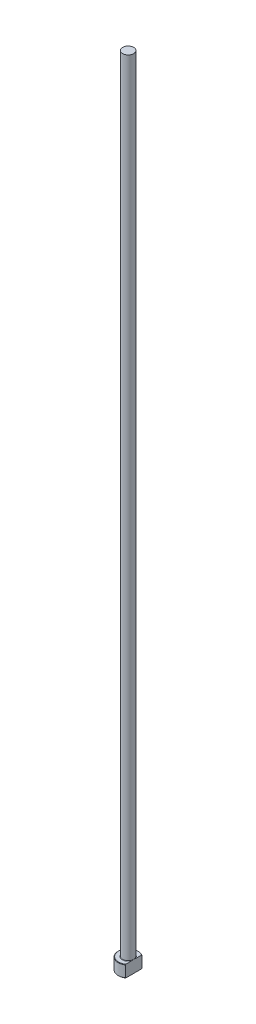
ISO-10303-21;
HEADER;
FILE_DESCRIPTION(('STEP AP214'),'2;1');
FILE_NAME('part.step','',(''),(''),'','','');
FILE_SCHEMA(('AUTOMOTIVE_DESIGN { 1 0 10303 214 1 1 1 1 }'));
ENDSEC;
DATA;
#1=APPLICATION_CONTEXT('core data for automotive mechanical design processes');
#2=APPLICATION_PROTOCOL_DEFINITION('international standard','automotive_design',2000,#1);
#3=PRODUCT_CONTEXT('',#1,'mechanical');
#4=PRODUCT('Part','Part','',(#3));
#5=PRODUCT_RELATED_PRODUCT_CATEGORY('part','',(#4));
#6=PRODUCT_DEFINITION_FORMATION('','',#4);
#7=PRODUCT_DEFINITION_CONTEXT('part definition',#1,'design');
#8=PRODUCT_DEFINITION('design','',#6,#7);
#9=PRODUCT_DEFINITION_SHAPE('','',#8);
#10=(LENGTH_UNIT() NAMED_UNIT(*) SI_UNIT(.MILLI.,.METRE.));
#11=(NAMED_UNIT(*) PLANE_ANGLE_UNIT() SI_UNIT($,.RADIAN.));
#12=(NAMED_UNIT(*) SI_UNIT($,.STERADIAN.) SOLID_ANGLE_UNIT());
#13=UNCERTAINTY_MEASURE_WITH_UNIT(LENGTH_MEASURE(1.E-05),#10,'distance_accuracy_value','');
#14=(GEOMETRIC_REPRESENTATION_CONTEXT(3) GLOBAL_UNCERTAINTY_ASSIGNED_CONTEXT((#13)) GLOBAL_UNIT_ASSIGNED_CONTEXT((#10,
#11,#12)) REPRESENTATION_CONTEXT('',''));
#15=CARTESIAN_POINT('',(0.,0.,0.));
#16=DIRECTION('',(0.,0.,1.));
#17=DIRECTION('',(1.,0.,0.));
#18=AXIS2_PLACEMENT_3D('',#15,#16,#17);
#19=CARTESIAN_POINT('',(0.,0.,0.));
#20=DIRECTION('',(0.,-1.,0.));
#21=DIRECTION('',(0.,0.,-1.));
#22=AXIS2_PLACEMENT_3D('',#19,#20,#21);
#23=PLANE('',#22);
#24=CARTESIAN_POINT('',(0.,0.,0.));
#25=DIRECTION('',(0.,-1.,0.));
#26=DIRECTION('',(0.,0.,-1.));
#27=AXIS2_PLACEMENT_3D('',#24,#25,#26);
#28=CIRCLE('',#27,4.79999999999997);
#29=CARTESIAN_POINT('',(2.74999999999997,0.,3.93414539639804));
#30=VERTEX_POINT('',#29);
#31=CARTESIAN_POINT('',(2.74999999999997,0.,-3.93414539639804));
#32=VERTEX_POINT('',#31);
#33=EDGE_CURVE('E98',#30,#32,#28,.T.);
#34=ORIENTED_EDGE('',*,*,#33,.T.);
#35=DIRECTION('',(0.,0.,1.));
#36=VECTOR('',#35,1.);
#37=CARTESIAN_POINT('',(2.74999999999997,0.,4.1758232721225));
#38=LINE('',#37,#36);
#39=EDGE_CURVE('E83',#32,#30,#38,.T.);
#40=ORIENTED_EDGE('',*,*,#39,.T.);
#41=EDGE_LOOP('',(#34,#40));
#42=FACE_BOUND('',#41,.T.);
#43=ADVANCED_FACE('F32',(#42),#23,.T.);
#44=CARTESIAN_POINT('',(0.,259.958771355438,0.));
#45=DIRECTION('',(0.,1.,0.));
#46=DIRECTION('',(0.,0.,1.));
#47=AXIS2_PLACEMENT_3D('',#44,#45,#46);
#48=CYLINDRICAL_SURFACE('',#47,4.99999999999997);
#49=CARTESIAN_POINT('',(0.,5.80000000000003,0.));
#50=DIRECTION('',(0.,1.,0.));
#51=DIRECTION('',(0.,0.,1.));
#52=AXIS2_PLACEMENT_3D('',#49,#50,#51);
#53=CIRCLE('',#52,4.99999999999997);
#54=CARTESIAN_POINT('',(2.74999999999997,5.80000000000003,4.1758232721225));
#55=VERTEX_POINT('',#54);
#56=CARTESIAN_POINT('',(2.74999999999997,5.80000000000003,-4.1758232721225));
#57=VERTEX_POINT('',#56);
#58=EDGE_CURVE('E104',#55,#57,#53,.F.);
#59=ORIENTED_EDGE('',*,*,#58,.T.);
#60=DIRECTION('',(0.,-1.,0.));
#61=VECTOR('',#60,1.);
#62=CARTESIAN_POINT('',(2.74999999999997,400.,-4.1758232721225));
#63=LINE('',#62,#61);
#64=CARTESIAN_POINT('',(2.74999999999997,0.199999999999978,-4.1758232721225));
#65=VERTEX_POINT('',#64);
#66=EDGE_CURVE('E183',#57,#65,#63,.T.);
#67=ORIENTED_EDGE('',*,*,#66,.T.);
#68=CARTESIAN_POINT('',(0.,0.199999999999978,0.));
#69=DIRECTION('',(0.,-1.,0.));
#70=DIRECTION('',(0.,0.,-1.));
#71=AXIS2_PLACEMENT_3D('',#68,#69,#70);
#72=CIRCLE('',#71,4.99999999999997);
#73=CARTESIAN_POINT('',(2.74999999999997,0.199999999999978,4.1758232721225));
#74=VERTEX_POINT('',#73);
#75=EDGE_CURVE('E100',#65,#74,#72,.F.);
#76=ORIENTED_EDGE('',*,*,#75,.T.);
#77=DIRECTION('',(0.,-1.,0.));
#78=VECTOR('',#77,1.);
#79=CARTESIAN_POINT('',(2.74999999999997,400.,4.1758232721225));
#80=LINE('',#79,#78);
#81=EDGE_CURVE('E93',#55,#74,#80,.T.);
#82=ORIENTED_EDGE('',*,*,#81,.F.);
#83=EDGE_LOOP('',(#59,#67,#76,#82));
#84=FACE_BOUND('',#83,.T.);
#85=ADVANCED_FACE('F158',(#84),#48,.T.);
#86=CARTESIAN_POINT('',(-4.99999999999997,6.,0.));
#87=DIRECTION('',(0.,1.,0.));
#88=DIRECTION('',(0.,0.,1.));
#89=AXIS2_PLACEMENT_3D('',#86,#87,#88);
#90=PLANE('',#89);
#91=CARTESIAN_POINT('',(0.,6.,0.));
#92=DIRECTION('',(0.,1.,0.));
#93=DIRECTION('',(0.,0.,1.));
#94=AXIS2_PLACEMENT_3D('',#91,#92,#93);
#95=CIRCLE('',#94,4.79999999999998);
#96=CARTESIAN_POINT('',(2.74999999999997,6.,-3.93414539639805));
#97=VERTEX_POINT('',#96);
#98=CARTESIAN_POINT('',(2.74999999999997,6.,3.93414539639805));
#99=VERTEX_POINT('',#98);
#100=EDGE_CURVE('E178',#97,#99,#95,.T.);
#101=ORIENTED_EDGE('',*,*,#100,.T.);
#102=DIRECTION('',(0.,0.,-1.));
#103=VECTOR('',#102,1.);
#104=CARTESIAN_POINT('',(2.74999999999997,6.,0.));
#105=LINE('',#104,#103);
#106=CARTESIAN_POINT('',(2.74999999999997,5.99999999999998,1.06770782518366));
#107=VERTEX_POINT('',#106);
#108=EDGE_CURVE('E57',#99,#107,#105,.T.);
#109=ORIENTED_EDGE('',*,*,#108,.T.);
#110=CARTESIAN_POINT('',(0.,6.,0.));
#111=DIRECTION('',(0.,1.,0.));
#112=DIRECTION('',(0.,0.,1.));
#113=AXIS2_PLACEMENT_3D('',#110,#111,#112);
#114=CIRCLE('',#113,2.94999999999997);
#115=CARTESIAN_POINT('',(2.74999999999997,5.99999999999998,-1.06770782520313));
#116=VERTEX_POINT('',#115);
#117=EDGE_CURVE('E107',#107,#116,#114,.F.);
#118=ORIENTED_EDGE('',*,*,#117,.T.);
#119=EDGE_CURVE('E136',#116,#97,#105,.T.);
#120=ORIENTED_EDGE('',*,*,#119,.T.);
#121=EDGE_LOOP('',(#101,#109,#118,#120));
#122=FACE_BOUND('',#121,.T.);
#123=ADVANCED_FACE('F147',(#122),#90,.T.);
#124=CARTESIAN_POINT('',(0.,6.00000000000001,0.));
#125=DIRECTION('',(0.,-1.,0.));
#126=DIRECTION('',(0.,0.,-1.));
#127=AXIS2_PLACEMENT_3D('',#124,#125,#126);
#128=CONICAL_SURFACE('',#127,4.79999999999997,0.785398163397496);
#129=ORIENTED_EDGE('',*,*,#58,.F.);
#130=CARTESIAN_POINT('',(2.74999999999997,1.20885441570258,9.18844783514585));
#131=CARTESIAN_POINT('',(2.74999999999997,1.37523675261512,9.0147689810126));
#132=CARTESIAN_POINT('',(2.74999999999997,1.5414218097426,8.84090089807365));
#133=CARTESIAN_POINT('',(2.74999999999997,1.87331224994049,8.49270511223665));
#134=CARTESIAN_POINT('',(2.74999999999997,2.03901762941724,8.31837740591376));
#135=CARTESIAN_POINT('',(2.74999999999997,2.53536746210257,7.79449769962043));
#136=CARTESIAN_POINT('',(2.74999999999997,2.86516041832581,7.44413786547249));
#137=CARTESIAN_POINT('',(2.74999999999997,3.52140645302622,6.74030951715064));
#138=CARTESIAN_POINT('',(2.74999999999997,3.84785962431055,6.38684108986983));
#139=CARTESIAN_POINT('',(2.74999999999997,4.33353933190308,5.85303151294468));
#140=CARTESIAN_POINT('',(2.74999999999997,4.49475728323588,5.67450358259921));
#141=CARTESIAN_POINT('',(2.74999999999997,4.8154555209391,5.31589537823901));
#142=CARTESIAN_POINT('',(2.74999999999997,4.97493583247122,5.13581512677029));
#143=CARTESIAN_POINT('',(2.74999999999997,5.28246157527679,4.78409714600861));
#144=CARTESIAN_POINT('',(2.74999999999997,5.43063567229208,4.6125721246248));
#145=CARTESIAN_POINT('',(2.74999999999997,5.72427023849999,4.26717959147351));
#146=CARTESIAN_POINT('',(2.74999999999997,5.86973045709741,4.09331186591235));
#147=CARTESIAN_POINT('',(2.74999999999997,6.15716227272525,3.74214491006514));
#148=CARTESIAN_POINT('',(2.74999999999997,6.29912659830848,3.56483970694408));
#149=CARTESIAN_POINT('',(2.74999999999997,6.57763983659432,3.20603939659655));
#150=CARTESIAN_POINT('',(2.74999999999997,6.7141898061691,3.02454511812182));
#151=CARTESIAN_POINT('',(2.74999999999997,6.93857405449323,2.71219163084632));
#152=CARTESIAN_POINT('',(2.74999999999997,7.02851673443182,2.58285434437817));
#153=CARTESIAN_POINT('',(2.74999999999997,7.20308451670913,2.32054245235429));
#154=CARTESIAN_POINT('',(2.74999999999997,7.28770764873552,2.18756652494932));
#155=CARTESIAN_POINT('',(2.74999999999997,7.44931959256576,1.91735675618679));
#156=CARTESIAN_POINT('',(2.74999999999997,7.52632375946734,1.7801322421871));
#157=CARTESIAN_POINT('',(2.74999999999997,7.66966790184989,1.50031327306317));
#158=CARTESIAN_POINT('',(2.74999999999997,7.73601725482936,1.35772367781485));
#159=CARTESIAN_POINT('',(2.74999999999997,7.86065113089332,1.04856386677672));
#160=CARTESIAN_POINT('',(2.74999999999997,7.91700799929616,0.881171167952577));
#161=CARTESIAN_POINT('',(2.74999999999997,7.9810280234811,0.625229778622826));
#162=CARTESIAN_POINT('',(2.74999999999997,7.99893817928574,0.539229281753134));
#163=CARTESIAN_POINT('',(2.74999999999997,8.02707157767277,0.365959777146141));
#164=CARTESIAN_POINT('',(2.74999999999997,8.03729562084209,0.278690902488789));
#165=CARTESIAN_POINT('',(2.74999999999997,8.04949232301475,0.102763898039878));
#166=CARTESIAN_POINT('',(2.74999999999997,8.05138838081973,0.0141003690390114));
#167=CARTESIAN_POINT('',(2.74999999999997,8.04659669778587,-0.162990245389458));
#168=CARTESIAN_POINT('',(2.74999999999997,8.03990892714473,-0.251417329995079));
#169=CARTESIAN_POINT('',(2.74999999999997,8.0183553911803,-0.427430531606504));
#170=CARTESIAN_POINT('',(2.74999999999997,8.00347341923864,-0.51501463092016));
#171=CARTESIAN_POINT('',(2.74999999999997,7.96636720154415,-0.688602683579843));
#172=CARTESIAN_POINT('',(2.74999999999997,7.94414138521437,-0.774606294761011));
#173=CARTESIAN_POINT('',(2.74999999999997,7.88037969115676,-0.988315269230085));
#174=CARTESIAN_POINT('',(2.74999999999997,7.8347849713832,-1.11480587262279));
#175=CARTESIAN_POINT('',(2.74999999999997,7.73271903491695,-1.36329985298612));
#176=CARTESIAN_POINT('',(2.74999999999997,7.67623944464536,-1.48529968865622));
#177=CARTESIAN_POINT('',(2.74999999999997,7.55498227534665,-1.72582737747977));
#178=CARTESIAN_POINT('',(2.74999999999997,7.49016436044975,-1.84433466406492));
#179=CARTESIAN_POINT('',(2.74999999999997,7.38849038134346,-2.01944141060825));
#180=CARTESIAN_POINT('',(2.74999999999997,7.35386385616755,-2.07735876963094));
#181=CARTESIAN_POINT('',(2.74999999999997,7.28331846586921,-2.19239883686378));
#182=CARTESIAN_POINT('',(2.74999999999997,7.24739965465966,-2.24952157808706));
#183=CARTESIAN_POINT('',(2.74999999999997,7.12488368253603,-2.44019263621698));
#184=CARTESIAN_POINT('',(2.74999999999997,7.03574833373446,-2.57211125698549));
#185=CARTESIAN_POINT('',(2.74999999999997,6.85300432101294,-2.83282496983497));
#186=CARTESIAN_POINT('',(2.74999999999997,6.7593946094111,-2.96161931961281));
#187=CARTESIAN_POINT('',(2.74999999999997,6.56878484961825,-3.2168121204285));
#188=CARTESIAN_POINT('',(2.74999999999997,6.47178237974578,-3.34320875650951));
#189=CARTESIAN_POINT('',(2.74999999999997,6.27524323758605,-3.59402090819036));
#190=CARTESIAN_POINT('',(2.74999999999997,6.17570641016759,-3.71843630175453));
#191=CARTESIAN_POINT('',(2.74999999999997,5.97442282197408,-3.96596722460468));
#192=CARTESIAN_POINT('',(2.74999999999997,5.8726712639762,-4.08907884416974));
#193=CARTESIAN_POINT('',(2.74999999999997,5.66760125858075,-4.3339916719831));
#194=CARTESIAN_POINT('',(2.74999999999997,5.56428277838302,-4.45579285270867));
#195=CARTESIAN_POINT('',(2.74999999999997,5.25255029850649,-4.81947940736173));
#196=CARTESIAN_POINT('',(2.74999999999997,5.04226620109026,-5.05976099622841));
#197=CARTESIAN_POINT('',(2.74999999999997,4.61812846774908,-5.5376054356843));
#198=CARTESIAN_POINT('',(2.74999999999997,4.40427119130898,-5.77516503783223));
#199=CARTESIAN_POINT('',(2.74999999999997,3.97415714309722,-6.24814387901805));
#200=CARTESIAN_POINT('',(2.74999999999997,3.75790012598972,-6.48356289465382));
#201=CARTESIAN_POINT('',(2.74999999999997,3.32391192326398,-6.95249982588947));
#202=CARTESIAN_POINT('',(2.74999999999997,3.10618287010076,-7.18601971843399));
#203=CARTESIAN_POINT('',(2.74999999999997,2.66941287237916,-7.65182952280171));
#204=CARTESIAN_POINT('',(2.74999999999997,2.45037192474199,-7.88411943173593));
#205=CARTESIAN_POINT('',(2.74999999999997,2.14586495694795,-8.20563072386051));
#206=CARTESIAN_POINT('',(2.74999999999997,2.06083046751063,-8.29526139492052));
#207=CARTESIAN_POINT('',(2.74999999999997,1.89060889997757,-8.47440444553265));
#208=CARTESIAN_POINT('',(2.74999999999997,1.80542180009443,-8.56391680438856));
#209=CARTESIAN_POINT('',(2.74999999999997,1.63506457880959,-8.74266965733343));
#210=CARTESIAN_POINT('',(2.74999999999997,1.5498946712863,-8.83191035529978));
#211=CARTESIAN_POINT('',(2.74999999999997,1.37945223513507,-9.01026683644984));
#212=CARTESIAN_POINT('',(2.74999999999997,1.29417972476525,-9.09938263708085));
#213=CARTESIAN_POINT('',(2.74999999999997,1.20885441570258,-9.18844783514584));
#214=B_SPLINE_CURVE_WITH_KNOTS('',3,(#130,#131,#132,#133,#134,#135,#136,#137,#138,#139,#140,
#141,#142,#143,#144,#145,#146,#147,#148,#149,#150,#151,#152,#153,#154,#155,#156,#157,#158,#159,
#160,#161,#162,#163,#164,#165,#166,#167,#168,#169,#170,#171,#172,#173,#174,#175,#176,#177,#178,
#179,#180,#181,#182,#183,#184,#185,#186,#187,#188,#189,#190,#191,#192,#193,#194,#195,#196,#197,
#198,#199,#200,#201,#202,#203,#204,#205,#206,#207,#208,#209,#210,#211,#212,#213),.UNSPECIFIED.,
.F.,.F.,(4,2,2,2,2,2,2,2,2,2,2,2,2,2,2,2,2,2,2,2,2,2,2,2,2,2,2,2,2,2,2,2,2,2,2,2,2,2,2,2,2,4),
(0.,0.721544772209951,1.44309493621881,2.88656432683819,4.32999349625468,5.05163004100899,
5.77325612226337,6.45322671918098,7.13325979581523,7.81460476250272,8.49581607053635,
8.96833065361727,9.4410192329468,9.91273488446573,10.3840330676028,10.9119743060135,
11.1752192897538,11.4384368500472,11.7040704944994,11.9697050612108,12.2358669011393,
12.5020857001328,12.9047274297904,13.3076801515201,13.712661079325,13.9150857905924,
14.1175020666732,14.5949844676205,15.0725792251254,15.5505221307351,16.0284943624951,
16.5076321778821,16.9867800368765,17.94463622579,18.9035363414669,19.862535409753,
20.8203587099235,21.7781842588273,22.1488332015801,22.5195401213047,22.889621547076,
23.259644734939),.UNSPECIFIED.);
#215=EDGE_CURVE('E135',#55,#99,#214,.T.);
#216=ORIENTED_EDGE('',*,*,#215,.T.);
#217=ORIENTED_EDGE('',*,*,#100,.F.);
#218=EDGE_CURVE('E127',#97,#57,#214,.T.);
#219=ORIENTED_EDGE('',*,*,#218,.T.);
#220=EDGE_LOOP('',(#129,#216,#217,#219));
#221=FACE_BOUND('',#220,.T.);
#222=ADVANCED_FACE('F143',(#221),#128,.T.);
#223=CARTESIAN_POINT('',(0.,0.199999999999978,0.));
#224=DIRECTION('',(0.,1.,0.));
#225=DIRECTION('',(0.,0.,1.));
#226=AXIS2_PLACEMENT_3D('',#223,#224,#225);
#227=CONICAL_SURFACE('',#226,4.99999999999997,0.785398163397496);
#228=ORIENTED_EDGE('',*,*,#75,.F.);
#229=CARTESIAN_POINT('',(2.74999999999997,4.79114558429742,-9.18844783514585));
#230=CARTESIAN_POINT('',(2.74999999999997,4.62476324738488,-9.0147689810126));
#231=CARTESIAN_POINT('',(2.74999999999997,4.45857819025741,-8.84090089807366));
#232=CARTESIAN_POINT('',(2.74999999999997,4.12668775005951,-8.49270511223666));
#233=CARTESIAN_POINT('',(2.74999999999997,3.96098237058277,-8.31837740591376));
#234=CARTESIAN_POINT('',(2.74999999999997,3.46463253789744,-7.79449769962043));
#235=CARTESIAN_POINT('',(2.74999999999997,3.13483958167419,-7.44413786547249));
#236=CARTESIAN_POINT('',(2.74999999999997,2.47859354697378,-6.74030951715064));
#237=CARTESIAN_POINT('',(2.74999999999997,2.15214037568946,-6.38684108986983));
#238=CARTESIAN_POINT('',(2.74999999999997,1.66646066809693,-5.85303151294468));
#239=CARTESIAN_POINT('',(2.74999999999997,1.50524271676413,-5.67450358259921));
#240=CARTESIAN_POINT('',(2.74999999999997,1.1845444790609,-5.31589537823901));
#241=CARTESIAN_POINT('',(2.74999999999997,1.02506416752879,-5.13581512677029));
#242=CARTESIAN_POINT('',(2.74999999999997,0.717538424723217,-4.78409714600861));
#243=CARTESIAN_POINT('',(2.74999999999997,0.569364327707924,-4.6125721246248));
#244=CARTESIAN_POINT('',(2.74999999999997,0.275729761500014,-4.26717959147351));
#245=CARTESIAN_POINT('',(2.74999999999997,0.130269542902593,-4.09331186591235));
#246=CARTESIAN_POINT('',(2.74999999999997,-0.157162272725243,-3.74214491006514));
#247=CARTESIAN_POINT('',(2.74999999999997,-0.299126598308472,-3.56483970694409));
#248=CARTESIAN_POINT('',(2.74999999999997,-0.577639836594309,-3.20603939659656));
#249=CARTESIAN_POINT('',(2.74999999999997,-0.714189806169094,-3.02454511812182));
#250=CARTESIAN_POINT('',(2.74999999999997,-0.938574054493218,-2.71219163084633));
#251=CARTESIAN_POINT('',(2.74999999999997,-1.02851673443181,-2.58285434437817));
#252=CARTESIAN_POINT('',(2.74999999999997,-1.20308451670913,-2.3205424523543));
#253=CARTESIAN_POINT('',(2.74999999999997,-1.28770764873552,-2.18756652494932));
#254=CARTESIAN_POINT('',(2.74999999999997,-1.44931959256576,-1.91735675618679));
#255=CARTESIAN_POINT('',(2.74999999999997,-1.52632375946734,-1.7801322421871));
#256=CARTESIAN_POINT('',(2.74999999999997,-1.66966790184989,-1.50031327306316));
#257=CARTESIAN_POINT('',(2.74999999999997,-1.73601725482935,-1.35772367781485));
#258=CARTESIAN_POINT('',(2.74999999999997,-1.86065113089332,-1.04856386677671));
#259=CARTESIAN_POINT('',(2.74999999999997,-1.91700799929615,-0.881171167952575));
#260=CARTESIAN_POINT('',(2.74999999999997,-1.9810280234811,-0.625229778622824));
#261=CARTESIAN_POINT('',(2.74999999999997,-1.99893817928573,-0.539229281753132));
#262=CARTESIAN_POINT('',(2.74999999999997,-2.02707157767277,-0.365959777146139));
#263=CARTESIAN_POINT('',(2.74999999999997,-2.03729562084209,-0.278690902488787));
#264=CARTESIAN_POINT('',(2.74999999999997,-2.04949232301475,-0.102763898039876));
#265=CARTESIAN_POINT('',(2.74999999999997,-2.05138838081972,-0.0141003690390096));
#266=CARTESIAN_POINT('',(2.74999999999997,-2.04659669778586,0.16299024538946));
#267=CARTESIAN_POINT('',(2.74999999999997,-2.03990892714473,0.25141732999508));
#268=CARTESIAN_POINT('',(2.74999999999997,-2.01835539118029,0.427430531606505));
#269=CARTESIAN_POINT('',(2.74999999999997,-2.00347341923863,0.515014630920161));
#270=CARTESIAN_POINT('',(2.74999999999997,-1.96636720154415,0.688602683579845));
#271=CARTESIAN_POINT('',(2.74999999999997,-1.94414138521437,0.774606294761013));
#272=CARTESIAN_POINT('',(2.74999999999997,-1.88037969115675,0.988315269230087));
#273=CARTESIAN_POINT('',(2.74999999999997,-1.8347849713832,1.11480587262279));
#274=CARTESIAN_POINT('',(2.74999999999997,-1.73271903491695,1.36329985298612));
#275=CARTESIAN_POINT('',(2.74999999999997,-1.67623944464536,1.48529968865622));
#276=CARTESIAN_POINT('',(2.74999999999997,-1.55498227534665,1.72582737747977));
#277=CARTESIAN_POINT('',(2.74999999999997,-1.49016436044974,1.84433466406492));
#278=CARTESIAN_POINT('',(2.74999999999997,-1.38849038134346,2.01944141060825));
#279=CARTESIAN_POINT('',(2.74999999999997,-1.35386385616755,2.07735876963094));
#280=CARTESIAN_POINT('',(2.74999999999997,-1.2833184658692,2.19239883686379));
#281=CARTESIAN_POINT('',(2.74999999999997,-1.24739965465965,2.24952157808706));
#282=CARTESIAN_POINT('',(2.74999999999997,-1.12488368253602,2.44019263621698));
#283=CARTESIAN_POINT('',(2.74999999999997,-1.03574833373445,2.57211125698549));
#284=CARTESIAN_POINT('',(2.74999999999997,-0.853004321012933,2.83282496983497));
#285=CARTESIAN_POINT('',(2.74999999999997,-0.759394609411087,2.96161931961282));
#286=CARTESIAN_POINT('',(2.74999999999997,-0.568784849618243,3.21681212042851));
#287=CARTESIAN_POINT('',(2.74999999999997,-0.471782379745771,3.34320875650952));
#288=CARTESIAN_POINT('',(2.74999999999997,-0.275243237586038,3.59402090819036));
#289=CARTESIAN_POINT('',(2.74999999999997,-0.175706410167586,3.71843630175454));
#290=CARTESIAN_POINT('',(2.74999999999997,0.0255771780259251,3.96596722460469));
#291=CARTESIAN_POINT('',(2.74999999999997,0.127328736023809,4.08907884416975));
#292=CARTESIAN_POINT('',(2.74999999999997,0.332398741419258,4.3339916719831));
#293=CARTESIAN_POINT('',(2.74999999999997,0.435717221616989,4.45579285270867));
#294=CARTESIAN_POINT('',(2.74999999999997,0.747449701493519,4.81947940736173));
#295=CARTESIAN_POINT('',(2.74999999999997,0.957733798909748,5.05976099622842));
#296=CARTESIAN_POINT('',(2.74999999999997,1.38187153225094,5.5376054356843));
#297=CARTESIAN_POINT('',(2.74999999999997,1.59572880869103,5.77516503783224));
#298=CARTESIAN_POINT('',(2.74999999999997,2.0258428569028,6.24814387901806));
#299=CARTESIAN_POINT('',(2.74999999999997,2.2420998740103,6.48356289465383));
#300=CARTESIAN_POINT('',(2.74999999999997,2.67608807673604,6.95249982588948));
#301=CARTESIAN_POINT('',(2.74999999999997,2.89381712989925,7.186019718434));
#302=CARTESIAN_POINT('',(2.74999999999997,3.33058712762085,7.65182952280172));
#303=CARTESIAN_POINT('',(2.74999999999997,3.54962807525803,7.88411943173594));
#304=CARTESIAN_POINT('',(2.74999999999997,3.85413504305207,8.20563072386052));
#305=CARTESIAN_POINT('',(2.74999999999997,3.93916953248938,8.29526139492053));
#306=CARTESIAN_POINT('',(2.74999999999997,4.10939110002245,8.47440444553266));
#307=CARTESIAN_POINT('',(2.74999999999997,4.19457819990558,8.56391680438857));
#308=CARTESIAN_POINT('',(2.74999999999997,4.36493542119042,8.74266965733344));
#309=CARTESIAN_POINT('',(2.74999999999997,4.45010532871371,8.83191035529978));
#310=CARTESIAN_POINT('',(2.74999999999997,4.62054776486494,9.01026683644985));
#311=CARTESIAN_POINT('',(2.74999999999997,4.70582027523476,9.09938263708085));
#312=CARTESIAN_POINT('',(2.74999999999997,4.79114558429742,9.18844783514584));
#313=B_SPLINE_CURVE_WITH_KNOTS('',3,(#229,#230,#231,#232,#233,#234,#235,#236,#237,#238,#239,
#240,#241,#242,#243,#244,#245,#246,#247,#248,#249,#250,#251,#252,#253,#254,#255,#256,#257,#258,
#259,#260,#261,#262,#263,#264,#265,#266,#267,#268,#269,#270,#271,#272,#273,#274,#275,#276,#277,
#278,#279,#280,#281,#282,#283,#284,#285,#286,#287,#288,#289,#290,#291,#292,#293,#294,#295,#296,
#297,#298,#299,#300,#301,#302,#303,#304,#305,#306,#307,#308,#309,#310,#311,#312),.UNSPECIFIED.,
.F.,.F.,(4,2,2,2,2,2,2,2,2,2,2,2,2,2,2,2,2,2,2,2,2,2,2,2,2,2,2,2,2,2,2,2,2,2,2,2,2,2,2,2,2,4),
(0.,0.721544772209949,1.4430949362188,2.88656432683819,4.32999349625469,5.05163004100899,
5.77325612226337,6.45322671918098,7.13325979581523,7.81460476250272,8.49581607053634,
8.96833065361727,9.4410192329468,9.91273488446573,10.3840330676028,10.9119743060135,
11.1752192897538,11.4384368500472,11.7040704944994,11.9697050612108,12.2358669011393,
12.5020857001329,12.9047274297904,13.3076801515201,13.712661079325,13.9150857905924,
14.1175020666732,14.5949844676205,15.0725792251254,15.5505221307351,16.0284943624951,
16.5076321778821,16.9867800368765,17.94463622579,18.9035363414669,19.862535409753,
20.8203587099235,21.7781842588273,22.1488332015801,22.5195401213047,22.889621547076,
23.259644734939),.UNSPECIFIED.);
#314=EDGE_CURVE('E86',#65,#32,#313,.T.);
#315=ORIENTED_EDGE('',*,*,#314,.T.);
#316=ORIENTED_EDGE('',*,*,#33,.F.);
#317=EDGE_CURVE('E89',#30,#74,#313,.T.);
#318=ORIENTED_EDGE('',*,*,#317,.T.);
#319=EDGE_LOOP('',(#228,#315,#316,#318));
#320=FACE_BOUND('',#319,.T.);
#321=ADVANCED_FACE('F97',(#320),#227,.T.);
#322=CARTESIAN_POINT('',(0.,6.19999999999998,0.));
#323=DIRECTION('',(0.,1.,0.));
#324=DIRECTION('',(0.,0.,1.));
#325=AXIS2_PLACEMENT_3D('',#322,#323,#324);
#326=TOROIDAL_SURFACE('',#325,2.94999999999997,0.2);
#327=CARTESIAN_POINT('',(2.74999999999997,6.19999999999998,0.));
#328=CARTESIAN_POINT('',(2.74999999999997,6.20000050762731,1.12997189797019E-10));
#329=CARTESIAN_POINT('',(2.74999999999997,6.20000101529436,-1.81527538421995E-07));
#330=CARTESIAN_POINT('',(2.74999999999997,6.20000196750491,-6.94840321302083E-07));
#331=CARTESIAN_POINT('',(2.74999999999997,6.20000240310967,-1.03787718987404E-06));
#332=CARTESIAN_POINT('',(2.74999999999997,6.20000330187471,-1.85808129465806E-06));
#333=CARTESIAN_POINT('',(2.74999999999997,6.20000375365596,-2.34835983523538E-06));
#334=CARTESIAN_POINT('',(2.74999999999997,6.20000456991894,-3.37046961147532E-06));
#335=CARTESIAN_POINT('',(2.74999999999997,6.20000493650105,-3.90074161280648E-06));
#336=CARTESIAN_POINT('',(2.74999999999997,6.20000627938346,-5.93261734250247E-06));
#337=CARTESIAN_POINT('',(2.74999999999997,6.20000718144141,-7.48563177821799E-06));
#338=CARTESIAN_POINT('',(2.74999999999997,6.20000868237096,-1.05790083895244E-05));
#339=CARTESIAN_POINT('',(2.74999999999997,6.20000929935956,-1.21109700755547E-05));
#340=CARTESIAN_POINT('',(2.74999999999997,6.20001185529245,-1.85322193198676E-05));
#341=CARTESIAN_POINT('',(2.74999999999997,6.20001373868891,-2.34472712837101E-05));
#342=CARTESIAN_POINT('',(2.74999999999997,6.20001654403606,-3.27779453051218E-05));
#343=CARTESIAN_POINT('',(2.74999999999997,6.20001756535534,-3.71636224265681E-05));
#344=CARTESIAN_POINT('',(2.74999999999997,6.20002495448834,-6.95743734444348E-05));
#345=CARTESIAN_POINT('',(2.74999999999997,6.20003050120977,-9.77394526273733E-05));
#346=CARTESIAN_POINT('',(2.74999999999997,6.20005478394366,-0.000208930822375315));
#347=CARTESIAN_POINT('',(2.74999999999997,6.20007801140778,-0.000290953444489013));
#348=CARTESIAN_POINT('',(2.74999999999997,6.20016837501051,-0.000615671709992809));
#349=CARTESIAN_POINT('',(2.74999999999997,6.20023256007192,-0.000858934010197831));
#350=CARTESIAN_POINT('',(2.74999999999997,6.20048946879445,-0.00182516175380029));
#351=CARTESIAN_POINT('',(2.74999999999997,6.20068588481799,-0.00254739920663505));
#352=CARTESIAN_POINT('',(2.74999999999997,6.2015014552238,-0.00555461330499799));
#353=CARTESIAN_POINT('',(2.74999999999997,6.20211597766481,-0.00784050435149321));
#354=CARTESIAN_POINT('',(2.74999999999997,6.2075464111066,-0.028030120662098));
#355=CARTESIAN_POINT('',(2.74999999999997,6.21238054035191,-0.045930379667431));
#356=CARTESIAN_POINT('',(2.74999999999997,6.22182435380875,-0.0810299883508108));
#357=CARTESIAN_POINT('',(2.74999999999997,6.22643534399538,-0.0982290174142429));
#358=CARTESIAN_POINT('',(2.74999999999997,6.23620184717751,-0.134808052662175));
#359=CARTESIAN_POINT('',(2.74999999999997,6.24135263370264,-0.154189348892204));
#360=CARTESIAN_POINT('',(2.74999999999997,6.25163624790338,-0.19318178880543));
#361=CARTESIAN_POINT('',(2.74999999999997,6.25676827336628,-0.212793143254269));
#362=CARTESIAN_POINT('',(2.74999999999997,6.26905119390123,-0.260223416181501));
#363=CARTESIAN_POINT('',(2.74999999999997,6.27615177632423,-0.288055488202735));
#364=CARTESIAN_POINT('',(2.74999999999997,6.28988618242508,-0.343037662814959));
#365=CARTESIAN_POINT('',(2.74999999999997,6.29652742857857,-0.37018592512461));
#366=CARTESIAN_POINT('',(2.74999999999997,6.3179119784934,-0.460013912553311));
#367=CARTESIAN_POINT('',(2.74999999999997,6.33192996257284,-0.522872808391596));
#368=CARTESIAN_POINT('',(2.74999999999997,6.35724782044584,-0.649858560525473));
#369=CARTESIAN_POINT('',(2.74999999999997,6.36851625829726,-0.71399176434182));
#370=CARTESIAN_POINT('',(2.74999999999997,6.38744836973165,-0.848144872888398));
#371=CARTESIAN_POINT('',(2.74999999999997,6.39474814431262,-0.918222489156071));
#372=CARTESIAN_POINT('',(2.74999999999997,6.39971832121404,-1.02344881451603));
#373=CARTESIAN_POINT('',(2.74999999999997,6.40038441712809,-1.05845158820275));
#374=CARTESIAN_POINT('',(2.74999999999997,6.39917295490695,-1.1284044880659));
#375=CARTESIAN_POINT('',(2.74999999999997,6.39729798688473,-1.16335463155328));
#376=CARTESIAN_POINT('',(2.74999999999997,6.39199994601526,-1.21505383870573));
#377=CARTESIAN_POINT('',(2.74999999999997,6.38986571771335,-1.23193598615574));
#378=CARTESIAN_POINT('',(2.74999999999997,6.38464996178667,-1.2655715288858));
#379=CARTESIAN_POINT('',(2.74999999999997,6.38156766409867,-1.28232480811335));
#380=CARTESIAN_POINT('',(2.74999999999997,6.37431364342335,-1.31540767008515));
#381=CARTESIAN_POINT('',(2.74999999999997,6.37015411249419,-1.33173987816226));
#382=CARTESIAN_POINT('',(2.74999999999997,6.36048976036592,-1.36399299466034));
#383=CARTESIAN_POINT('',(2.74999999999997,6.35498646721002,-1.37991434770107));
#384=CARTESIAN_POINT('',(2.74999999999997,6.34222746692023,-1.41123903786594));
#385=CARTESIAN_POINT('',(2.74999999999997,6.33495457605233,-1.42663549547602));
#386=CARTESIAN_POINT('',(2.74999999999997,6.318175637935,-1.45617471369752));
#387=CARTESIAN_POINT('',(2.74999999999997,6.30867792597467,-1.4703218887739));
#388=CARTESIAN_POINT('',(2.74999999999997,6.29277007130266,-1.48907990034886));
#389=CARTESIAN_POINT('',(2.74999999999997,6.2875192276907,-1.49466894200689));
#390=CARTESIAN_POINT('',(2.74999999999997,6.27634440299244,-1.50515028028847));
#391=CARTESIAN_POINT('',(2.74999999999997,6.27042002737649,-1.51004216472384));
#392=CARTESIAN_POINT('',(2.74999999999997,6.25778482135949,-1.51891099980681));
#393=CARTESIAN_POINT('',(2.74999999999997,6.2510643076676,-1.52287446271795));
#394=CARTESIAN_POINT('',(2.74999999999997,6.23698143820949,-1.52941740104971));
#395=CARTESIAN_POINT('',(2.74999999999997,6.22962116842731,-1.53200119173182));
#396=CARTESIAN_POINT('',(2.74999999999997,6.2166326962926,-1.53496289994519));
#397=CARTESIAN_POINT('',(2.74999999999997,6.2110985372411,-1.53575651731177));
#398=CARTESIAN_POINT('',(2.74999999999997,6.19997558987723,-1.53638738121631));
#399=CARTESIAN_POINT('',(2.74999999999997,6.19438682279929,-1.53622498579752));
#400=CARTESIAN_POINT('',(2.74999999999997,6.18332943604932,-1.53495937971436));
#401=CARTESIAN_POINT('',(2.74999999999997,6.17786061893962,-1.53385785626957));
#402=CARTESIAN_POINT('',(2.74999999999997,6.16716525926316,-1.53080991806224));
#403=CARTESIAN_POINT('',(2.74999999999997,6.16193889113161,-1.52886290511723));
#404=CARTESIAN_POINT('',(2.74999999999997,6.14983366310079,-1.52335528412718));
#405=CARTESIAN_POINT('',(2.74999999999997,6.14310699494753,-1.51946144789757));
#406=CARTESIAN_POINT('',(2.74999999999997,6.13035821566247,-1.51065443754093));
#407=CARTESIAN_POINT('',(2.74999999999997,6.12433789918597,-1.5057387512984));
#408=CARTESIAN_POINT('',(2.74999999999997,6.10956608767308,-1.4920109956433));
#409=CARTESIAN_POINT('',(2.74999999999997,6.10134587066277,-1.48263193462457));
#410=CARTESIAN_POINT('',(2.74999999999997,6.08638427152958,-1.46278796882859));
#411=CARTESIAN_POINT('',(2.74999999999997,6.07964511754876,-1.45232146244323));
#412=CARTESIAN_POINT('',(2.74999999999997,6.06171675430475,-1.42080727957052));
#413=CARTESIAN_POINT('',(2.74999999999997,6.05211924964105,-1.39886385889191));
#414=CARTESIAN_POINT('',(2.74999999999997,6.03592584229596,-1.35377597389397));
#415=CARTESIAN_POINT('',(2.74999999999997,6.02935693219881,-1.33062268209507));
#416=CARTESIAN_POINT('',(2.74999999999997,6.01641276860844,-1.27469229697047));
#417=CARTESIAN_POINT('',(2.74999999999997,6.01110503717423,-1.24167224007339));
#418=CARTESIAN_POINT('',(2.74999999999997,6.00364182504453,-1.17522319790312));
#419=CARTESIAN_POINT('',(2.74999999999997,6.00149608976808,-1.1417932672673));
#420=CARTESIAN_POINT('',(2.74999999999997,5.99965905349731,-1.07618467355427));
#421=CARTESIAN_POINT('',(2.74999999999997,5.9998750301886,-1.04400821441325));
#422=CARTESIAN_POINT('',(2.74999999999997,6.00208041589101,-0.979705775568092));
#423=CARTESIAN_POINT('',(2.74999999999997,6.0040708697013,-0.947579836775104));
#424=CARTESIAN_POINT('',(2.74999999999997,6.01231998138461,-0.849711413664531));
#425=CARTESIAN_POINT('',(2.74999999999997,6.0208659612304,-0.784164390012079));
#426=CARTESIAN_POINT('',(2.74999999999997,6.04217753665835,-0.65215352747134));
#427=CARTESIAN_POINT('',(2.74999999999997,6.05504187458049,-0.585706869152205));
#428=CARTESIAN_POINT('',(2.74999999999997,6.07899589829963,-0.474257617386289));
#429=CARTESIAN_POINT('',(2.74999999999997,6.08936705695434,-0.429096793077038));
#430=CARTESIAN_POINT('',(2.74999999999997,6.11088695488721,-0.339494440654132));
#431=CARTESIAN_POINT('',(2.74999999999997,6.1220257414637,-0.295050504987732));
#432=CARTESIAN_POINT('',(2.74999999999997,6.14355229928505,-0.211341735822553));
#433=CARTESIAN_POINT('',(2.74999999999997,6.15388178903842,-0.172061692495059));
#434=CARTESIAN_POINT('',(2.74999999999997,6.17523671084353,-0.0918970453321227));
#435=CARTESIAN_POINT('',(2.74999999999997,6.18627305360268,-0.0510152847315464));
#436=CARTESIAN_POINT('',(2.74999999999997,6.19788514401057,-0.00783595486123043));
#437=CARTESIAN_POINT('',(2.74999999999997,6.19850096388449,-0.00554554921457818));
#438=CARTESIAN_POINT('',(2.74999999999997,6.19931683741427,-0.0025373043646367));
#439=CARTESIAN_POINT('',(2.74999999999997,6.19951229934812,-0.00181855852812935));
#440=CARTESIAN_POINT('',(2.74999999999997,6.19976804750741,-0.000856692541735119));
#441=CARTESIAN_POINT('',(2.74999999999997,6.19983200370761,-0.000614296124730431));
#442=CARTESIAN_POINT('',(2.74999999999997,6.19992209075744,-0.000290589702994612));
#443=CARTESIAN_POINT('',(2.74999999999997,6.19994527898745,-0.000208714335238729));
#444=CARTESIAN_POINT('',(2.74999999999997,6.19996952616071,-9.76928431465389E-05));
#445=CARTESIAN_POINT('',(2.74999999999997,6.19997506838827,-6.95486159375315E-05));
#446=CARTESIAN_POINT('',(2.74999999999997,6.19998244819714,-3.7159091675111E-05));
#447=CARTESIAN_POINT('',(2.74999999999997,6.19998346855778,-3.27745922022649E-05));
#448=CARTESIAN_POINT('',(2.74999999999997,6.19998627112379,-2.34463159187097E-05));
#449=CARTESIAN_POINT('',(2.74999999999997,6.19998815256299,-1.85324215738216E-05));
#450=CARTESIAN_POINT('',(2.74999999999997,6.19999070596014,-1.21123670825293E-05));
#451=CARTESIAN_POINT('',(2.74999999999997,6.19999132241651,-1.05804935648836E-05));
#452=CARTESIAN_POINT('',(2.74999999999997,6.19999282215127,-7.48720405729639E-06));
#453=CARTESIAN_POINT('',(2.74999999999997,6.19999372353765,-5.93417788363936E-06));
#454=CARTESIAN_POINT('',(2.74999999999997,6.19999506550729,-3.90218207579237E-06));
#455=CARTESIAN_POINT('',(2.74999999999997,6.19999543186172,-3.37185002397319E-06));
#456=CARTESIAN_POINT('',(2.74999999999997,6.19999624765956,-2.34957905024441E-06));
#457=CARTESIAN_POINT('',(2.74999999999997,6.19999669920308,-1.8591980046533E-06));
#458=CARTESIAN_POINT('',(2.74999999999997,6.19999759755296,-1.0387521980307E-06));
#459=CARTESIAN_POINT('',(2.74999999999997,6.19999803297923,-6.95584903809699E-07));
#460=CARTESIAN_POINT('',(2.74999999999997,6.19999898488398,-1.81944082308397E-07));
#461=CARTESIAN_POINT('',(2.74999999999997,6.19999949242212,-1.12986177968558E-10));
#462=CARTESIAN_POINT('',(2.74999999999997,6.19999999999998,0.));
#463=B_SPLINE_CURVE_WITH_KNOTS('',3,(#327,#328,#329,#330,#331,#332,#333,#334,#335,#336,#337,
#338,#339,#340,#341,#342,#343,#344,#345,#346,#347,#348,#349,#350,#351,#352,#353,#354,#355,#356,
#357,#358,#359,#360,#361,#362,#363,#364,#365,#366,#367,#368,#369,#370,#371,#372,#373,#374,#375,
#376,#377,#378,#379,#380,#381,#382,#383,#384,#385,#386,#387,#388,#389,#390,#391,#392,#393,#394,
#395,#396,#397,#398,#399,#400,#401,#402,#403,#404,#405,#406,#407,#408,#409,#410,#411,#412,#413,
#414,#415,#416,#417,#418,#419,#420,#421,#422,#423,#424,#425,#426,#427,#428,#429,#430,#431,#432,
#433,#434,#435,#436,#437,#438,#439,#440,#441,#442,#443,#444,#445,#446,#447,#448,#449,#450,#451,
#452,#453,#454,#455,#456,#457,#458,#459,#460,#461,#462),.UNSPECIFIED.,.T.,.F.,(4,2,2,2,2,2,2,2,
2,2,2,2,2,2,2,2,2,2,2,2,2,2,2,2,2,2,2,2,2,2,2,2,2,2,2,2,2,2,2,2,2,2,2,2,2,2,2,2,2,2,2,2,2,2,2,2,
2,2,2,2,2,2,2,2,2,2,2,4),(0.,1.53302756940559E-06,3.19538918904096E-06,5.18410384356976E-06,
7.11680690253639E-06,1.2484326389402E-05,1.74346119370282E-05,3.31954282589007E-05,
4.66876451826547E-05,0.000132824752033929,0.000388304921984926,0.00114333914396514,
0.00338841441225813,0.0104899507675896,0.0661127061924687,0.119532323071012,0.179694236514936,
0.240509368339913,0.326678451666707,0.410524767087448,0.603684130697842,0.79895806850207,
1.0099765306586,1.1149423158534,1.21980118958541,1.27083021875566,1.32190080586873,
1.37241688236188,1.42287578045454,1.47384571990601,1.52462767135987,1.54758745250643,
1.57056075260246,1.59384955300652,1.6170650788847,1.63376109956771,1.65045086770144,
1.66711071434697,1.68378236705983,1.70696786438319,1.73021104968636,1.76741395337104,
1.80467244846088,1.87612299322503,1.94819858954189,2.04828679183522,2.14868283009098,
2.24515187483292,2.3416777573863,2.53976637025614,2.74273377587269,2.8817318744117,
3.01918106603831,3.14102752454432,3.2680585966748,3.27517420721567,3.27740842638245,
3.27816077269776,3.27841579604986,3.27850186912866,3.27851535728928,3.27853111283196,
3.27853606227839,3.27854142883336,3.27854336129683,3.27854534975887,3.27854701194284,
3.27854854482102),.UNSPECIFIED.);
#464=CARTESIAN_POINT('',(2.74999999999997,6.19999999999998,0.));
#465=VERTEX_POINT('',#464);
#466=EDGE_CURVE('E11',#116,#465,#463,.T.);
#467=ORIENTED_EDGE('',*,*,#466,.F.);
#468=ORIENTED_EDGE('',*,*,#117,.F.);
#469=CARTESIAN_POINT('',(2.74999999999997,6.19999999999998,0.));
#470=CARTESIAN_POINT('',(2.74999999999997,6.19999949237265,-1.12997154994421E-10));
#471=CARTESIAN_POINT('',(2.74999999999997,6.1999989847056,1.81527538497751E-07));
#472=CARTESIAN_POINT('',(2.74999999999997,6.19999803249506,6.94840321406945E-07));
#473=CARTESIAN_POINT('',(2.74999999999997,6.19999759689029,1.03787718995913E-06));
#474=CARTESIAN_POINT('',(2.74999999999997,6.19999669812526,1.85808129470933E-06));
#475=CARTESIAN_POINT('',(2.74999999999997,6.19999624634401,2.3483598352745E-06));
#476=CARTESIAN_POINT('',(2.74999999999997,6.19999543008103,3.37046961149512E-06));
#477=CARTESIAN_POINT('',(2.74999999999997,6.19999506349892,3.90074161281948E-06));
#478=CARTESIAN_POINT('',(2.74999999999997,6.19999372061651,5.93261734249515E-06));
#479=CARTESIAN_POINT('',(2.74999999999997,6.19999281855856,7.48563177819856E-06));
#480=CARTESIAN_POINT('',(2.74999999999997,6.199991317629,1.05790083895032E-05));
#481=CARTESIAN_POINT('',(2.74999999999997,6.19999070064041,1.21109700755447E-05));
#482=CARTESIAN_POINT('',(2.74999999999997,6.19998814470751,1.85322193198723E-05));
#483=CARTESIAN_POINT('',(2.74999999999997,6.19998626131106,2.3447271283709E-05));
#484=CARTESIAN_POINT('',(2.74999999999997,6.19998345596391,3.27779453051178E-05));
#485=CARTESIAN_POINT('',(2.74999999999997,6.19998243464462,3.71636224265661E-05));
#486=CARTESIAN_POINT('',(2.74999999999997,6.19997504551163,6.95743734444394E-05));
#487=CARTESIAN_POINT('',(2.74999999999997,6.1999694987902,9.77394526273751E-05));
#488=CARTESIAN_POINT('',(2.74999999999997,6.19994521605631,0.000208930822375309));
#489=CARTESIAN_POINT('',(2.74999999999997,6.19992198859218,0.000290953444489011));
#490=CARTESIAN_POINT('',(2.74999999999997,6.19983162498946,0.000615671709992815));
#491=CARTESIAN_POINT('',(2.74999999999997,6.19976743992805,0.000858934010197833));
#492=CARTESIAN_POINT('',(2.74999999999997,6.19951053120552,0.00182516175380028));
#493=CARTESIAN_POINT('',(2.74999999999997,6.19931411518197,0.00254739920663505));
#494=CARTESIAN_POINT('',(2.74999999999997,6.19849854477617,0.005554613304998));
#495=CARTESIAN_POINT('',(2.74999999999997,6.19788402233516,0.00784050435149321));
#496=CARTESIAN_POINT('',(2.74999999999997,6.19245358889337,0.028030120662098));
#497=CARTESIAN_POINT('',(2.74999999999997,6.18761945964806,0.045930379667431));
#498=CARTESIAN_POINT('',(2.74999999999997,6.17817564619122,0.0810299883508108));
#499=CARTESIAN_POINT('',(2.74999999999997,6.17356465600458,0.0982290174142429));
#500=CARTESIAN_POINT('',(2.74999999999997,6.16379815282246,0.134808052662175));
#501=CARTESIAN_POINT('',(2.74999999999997,6.15864736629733,0.154189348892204));
#502=CARTESIAN_POINT('',(2.74999999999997,6.14836375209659,0.19318178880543));
#503=CARTESIAN_POINT('',(2.74999999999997,6.14323172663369,0.212793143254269));
#504=CARTESIAN_POINT('',(2.74999999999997,6.13094880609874,0.260223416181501));
#505=CARTESIAN_POINT('',(2.74999999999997,6.12384822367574,0.288055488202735));
#506=CARTESIAN_POINT('',(2.74999999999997,6.11011381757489,0.343037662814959));
#507=CARTESIAN_POINT('',(2.74999999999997,6.10347257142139,0.37018592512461));
#508=CARTESIAN_POINT('',(2.74999999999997,6.08208802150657,0.460013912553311));
#509=CARTESIAN_POINT('',(2.74999999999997,6.06807003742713,0.522872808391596));
#510=CARTESIAN_POINT('',(2.74999999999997,6.04275217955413,0.649858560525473));
#511=CARTESIAN_POINT('',(2.74999999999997,6.03148374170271,0.71399176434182));
#512=CARTESIAN_POINT('',(2.74999999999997,6.01255163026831,0.848144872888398));
#513=CARTESIAN_POINT('',(2.74999999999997,6.00525185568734,0.918222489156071));
#514=CARTESIAN_POINT('',(2.74999999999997,6.00028167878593,1.02344881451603));
#515=CARTESIAN_POINT('',(2.74999999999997,5.99961558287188,1.05845158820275));
#516=CARTESIAN_POINT('',(2.74999999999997,6.00082704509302,1.1284044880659));
#517=CARTESIAN_POINT('',(2.74999999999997,6.00270201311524,1.16335463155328));
#518=CARTESIAN_POINT('',(2.74999999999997,6.00800005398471,1.21505383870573));
#519=CARTESIAN_POINT('',(2.74999999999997,6.01013428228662,1.23193598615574));
#520=CARTESIAN_POINT('',(2.74999999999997,6.0153500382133,1.2655715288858));
#521=CARTESIAN_POINT('',(2.74999999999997,6.0184323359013,1.28232480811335));
#522=CARTESIAN_POINT('',(2.74999999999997,6.02568635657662,1.31540767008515));
#523=CARTESIAN_POINT('',(2.74999999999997,6.02984588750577,1.33173987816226));
#524=CARTESIAN_POINT('',(2.74999999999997,6.03951023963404,1.36399299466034));
#525=CARTESIAN_POINT('',(2.74999999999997,6.04501353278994,1.37991434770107));
#526=CARTESIAN_POINT('',(2.74999999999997,6.05777253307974,1.41123903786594));
#527=CARTESIAN_POINT('',(2.74999999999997,6.06504542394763,1.42663549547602));
#528=CARTESIAN_POINT('',(2.74999999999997,6.08182436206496,1.45617471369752));
#529=CARTESIAN_POINT('',(2.74999999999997,6.09132207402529,1.4703218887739));
#530=CARTESIAN_POINT('',(2.74999999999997,6.10722992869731,1.48907990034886));
#531=CARTESIAN_POINT('',(2.74999999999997,6.11248077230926,1.49466894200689));
#532=CARTESIAN_POINT('',(2.74999999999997,6.12365559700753,1.50515028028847));
#533=CARTESIAN_POINT('',(2.74999999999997,6.12957997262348,1.51004216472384));
#534=CARTESIAN_POINT('',(2.74999999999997,6.14221517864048,1.51891099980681));
#535=CARTESIAN_POINT('',(2.74999999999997,6.14893569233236,1.52287446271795));
#536=CARTESIAN_POINT('',(2.74999999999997,6.16301856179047,1.52941740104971));
#537=CARTESIAN_POINT('',(2.74999999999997,6.17037883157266,1.53200119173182));
#538=CARTESIAN_POINT('',(2.74999999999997,6.18336730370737,1.53496289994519));
#539=CARTESIAN_POINT('',(2.74999999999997,6.18890146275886,1.53575651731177));
#540=CARTESIAN_POINT('',(2.74999999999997,6.20002441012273,1.53638738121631));
#541=CARTESIAN_POINT('',(2.74999999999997,6.20561317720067,1.53622498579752));
#542=CARTESIAN_POINT('',(2.74999999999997,6.21667056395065,1.53495937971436));
#543=CARTESIAN_POINT('',(2.74999999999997,6.22213938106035,1.53385785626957));
#544=CARTESIAN_POINT('',(2.74999999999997,6.23283474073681,1.53080991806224));
#545=CARTESIAN_POINT('',(2.74999999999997,6.23806110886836,1.52886290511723));
#546=CARTESIAN_POINT('',(2.74999999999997,6.25016633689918,1.52335528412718));
#547=CARTESIAN_POINT('',(2.74999999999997,6.25689300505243,1.51946144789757));
#548=CARTESIAN_POINT('',(2.74999999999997,6.26964178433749,1.51065443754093));
#549=CARTESIAN_POINT('',(2.74999999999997,6.275662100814,1.5057387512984));
#550=CARTESIAN_POINT('',(2.74999999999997,6.29043391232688,1.4920109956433));
#551=CARTESIAN_POINT('',(2.74999999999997,6.2986541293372,1.48263193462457));
#552=CARTESIAN_POINT('',(2.74999999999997,6.31361572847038,1.46278796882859));
#553=CARTESIAN_POINT('',(2.74999999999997,6.32035488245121,1.45232146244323));
#554=CARTESIAN_POINT('',(2.74999999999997,6.33828324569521,1.42080727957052));
#555=CARTESIAN_POINT('',(2.74999999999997,6.34788075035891,1.39886385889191));
#556=CARTESIAN_POINT('',(2.74999999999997,6.364074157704,1.35377597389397));
#557=CARTESIAN_POINT('',(2.74999999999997,6.37064306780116,1.33062268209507));
#558=CARTESIAN_POINT('',(2.74999999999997,6.38358723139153,1.27469229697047));
#559=CARTESIAN_POINT('',(2.74999999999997,6.38889496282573,1.24167224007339));
#560=CARTESIAN_POINT('',(2.74999999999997,6.39635817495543,1.17522319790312));
#561=CARTESIAN_POINT('',(2.74999999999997,6.39850391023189,1.1417932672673));
#562=CARTESIAN_POINT('',(2.74999999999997,6.40034094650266,1.07618467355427));
#563=CARTESIAN_POINT('',(2.74999999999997,6.40012496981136,1.04400821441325));
#564=CARTESIAN_POINT('',(2.74999999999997,6.39791958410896,0.979705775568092));
#565=CARTESIAN_POINT('',(2.74999999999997,6.39592913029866,0.947579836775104));
#566=CARTESIAN_POINT('',(2.74999999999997,6.38768001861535,0.849711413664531));
#567=CARTESIAN_POINT('',(2.74999999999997,6.37913403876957,0.784164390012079));
#568=CARTESIAN_POINT('',(2.74999999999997,6.35782246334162,0.65215352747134));
#569=CARTESIAN_POINT('',(2.74999999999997,6.34495812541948,0.585706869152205));
#570=CARTESIAN_POINT('',(2.74999999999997,6.32100410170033,0.474257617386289));
#571=CARTESIAN_POINT('',(2.74999999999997,6.31063294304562,0.429096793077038));
#572=CARTESIAN_POINT('',(2.74999999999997,6.28911304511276,0.339494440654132));
#573=CARTESIAN_POINT('',(2.74999999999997,6.27797425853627,0.295050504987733));
#574=CARTESIAN_POINT('',(2.74999999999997,6.25644770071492,0.211341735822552));
#575=CARTESIAN_POINT('',(2.74999999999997,6.24611821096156,0.172061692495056));
#576=CARTESIAN_POINT('',(2.74999999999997,6.22476328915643,0.0918970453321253));
#577=CARTESIAN_POINT('',(2.74999999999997,6.21372694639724,0.0510152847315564));
#578=CARTESIAN_POINT('',(2.74999999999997,6.2021148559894,0.00783595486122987));
#579=CARTESIAN_POINT('',(2.74999999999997,6.20149903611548,0.00554554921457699));
#580=CARTESIAN_POINT('',(2.74999999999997,6.20068316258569,0.00253730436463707));
#581=CARTESIAN_POINT('',(2.74999999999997,6.20048770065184,0.00181855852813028));
#582=CARTESIAN_POINT('',(2.74999999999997,6.20023195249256,0.000856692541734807));
#583=CARTESIAN_POINT('',(2.74999999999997,6.20016799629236,0.00061429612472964));
#584=CARTESIAN_POINT('',(2.74999999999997,6.20007790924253,0.00029058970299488));
#585=CARTESIAN_POINT('',(2.74999999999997,6.20005472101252,0.000208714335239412));
#586=CARTESIAN_POINT('',(2.74999999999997,6.20003047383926,9.76928431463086E-05));
#587=CARTESIAN_POINT('',(2.74999999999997,6.2000249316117,6.95486159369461E-05));
#588=CARTESIAN_POINT('',(2.74999999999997,6.20001755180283,3.71590916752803E-05));
#589=CARTESIAN_POINT('',(2.74999999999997,6.20001653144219,3.27745922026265E-05));
#590=CARTESIAN_POINT('',(2.74999999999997,6.20001372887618,2.34463159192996E-05));
#591=CARTESIAN_POINT('',(2.74999999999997,6.20001184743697,1.85324215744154E-05));
#592=CARTESIAN_POINT('',(2.74999999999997,6.20000929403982,1.2112367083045E-05));
#593=CARTESIAN_POINT('',(2.74999999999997,6.20000867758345,1.05804935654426E-05));
#594=CARTESIAN_POINT('',(2.74999999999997,6.20000717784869,7.48720405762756E-06));
#595=CARTESIAN_POINT('',(2.74999999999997,6.20000627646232,5.93417788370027E-06));
#596=CARTESIAN_POINT('',(2.74999999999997,6.20000493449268,3.90218207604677E-06));
#597=CARTESIAN_POINT('',(2.74999999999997,6.20000456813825,3.37185002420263E-06));
#598=CARTESIAN_POINT('',(2.74999999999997,6.20000375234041,2.34957905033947E-06));
#599=CARTESIAN_POINT('',(2.74999999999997,6.20000330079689,1.85919800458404E-06));
#600=CARTESIAN_POINT('',(2.74999999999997,6.20000240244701,1.03875219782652E-06));
#601=CARTESIAN_POINT('',(2.74999999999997,6.20000196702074,6.95584903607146E-07));
#602=CARTESIAN_POINT('',(2.74999999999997,6.20000101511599,1.81944082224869E-07));
#603=CARTESIAN_POINT('',(2.74999999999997,6.20000050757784,1.12986143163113E-10));
#604=CARTESIAN_POINT('',(2.74999999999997,6.19999999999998,0.));
#605=B_SPLINE_CURVE_WITH_KNOTS('',3,(#469,#470,#471,#472,#473,#474,#475,#476,#477,#478,#479,
#480,#481,#482,#483,#484,#485,#486,#487,#488,#489,#490,#491,#492,#493,#494,#495,#496,#497,#498,
#499,#500,#501,#502,#503,#504,#505,#506,#507,#508,#509,#510,#511,#512,#513,#514,#515,#516,#517,
#518,#519,#520,#521,#522,#523,#524,#525,#526,#527,#528,#529,#530,#531,#532,#533,#534,#535,#536,
#537,#538,#539,#540,#541,#542,#543,#544,#545,#546,#547,#548,#549,#550,#551,#552,#553,#554,#555,
#556,#557,#558,#559,#560,#561,#562,#563,#564,#565,#566,#567,#568,#569,#570,#571,#572,#573,#574,
#575,#576,#577,#578,#579,#580,#581,#582,#583,#584,#585,#586,#587,#588,#589,#590,#591,#592,#593,
#594,#595,#596,#597,#598,#599,#600,#601,#602,#603,#604),.UNSPECIFIED.,.T.,.F.,(4,2,2,2,2,2,2,2,
2,2,2,2,2,2,2,2,2,2,2,2,2,2,2,2,2,2,2,2,2,2,2,2,2,2,2,2,2,2,2,2,2,2,2,2,2,2,2,2,2,2,2,2,2,2,2,2,
2,2,2,2,2,2,2,2,2,2,2,4),(0.,1.53302756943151E-06,3.1953891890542E-06,5.18410384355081E-06,
7.11680690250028E-06,1.24843263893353E-05,1.74346119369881E-05,3.31954282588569E-05,
4.66876451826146E-05,0.000132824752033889,0.000388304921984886,0.0011433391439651,
0.00338841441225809,0.0104899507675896,0.0661127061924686,0.119532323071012,0.179694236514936,
0.240509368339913,0.326678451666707,0.410524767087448,0.603684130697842,0.79895806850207,
1.0099765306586,1.1149423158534,1.21980118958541,1.27083021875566,1.32190080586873,
1.37241688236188,1.42287578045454,1.47384571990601,1.52462767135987,1.54758745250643,
1.57056075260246,1.59384955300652,1.6170650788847,1.63376109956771,1.65045086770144,
1.66711071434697,1.68378236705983,1.70696786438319,1.73021104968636,1.76741395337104,
1.80467244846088,1.87612299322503,1.94819858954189,2.04828679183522,2.14868283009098,
2.24515187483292,2.3416777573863,2.53976637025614,2.74273377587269,2.8817318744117,
3.01918106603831,3.14102752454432,3.2680585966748,3.27517420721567,3.27740842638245,
3.27816077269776,3.27841579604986,3.27850186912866,3.27851535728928,3.27853111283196,
3.27853606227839,3.27854142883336,3.27854336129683,3.27854534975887,3.27854701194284,
3.27854854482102),.UNSPECIFIED.);
#606=EDGE_CURVE('E46',#465,#107,#605,.T.);
#607=ORIENTED_EDGE('',*,*,#606,.F.);
#608=CARTESIAN_POINT('',(0.,6.19999999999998,0.));
#609=DIRECTION('',(0.,1.,0.));
#610=DIRECTION('',(0.,0.,1.));
#611=AXIS2_PLACEMENT_3D('',#608,#609,#610);
#612=CIRCLE('',#611,2.74999999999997);
#613=EDGE_CURVE('E103',#465,#465,#612,.T.);
#614=ORIENTED_EDGE('',*,*,#613,.F.);
#615=EDGE_LOOP('',(#467,#468,#607,#614));
#616=FACE_BOUND('',#615,.T.);
#617=ADVANCED_FACE('F34',(#616),#326,.F.);
#618=CARTESIAN_POINT('',(0.,259.958771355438,0.));
#619=DIRECTION('',(0.,1.,0.));
#620=DIRECTION('',(0.,0.,1.));
#621=AXIS2_PLACEMENT_3D('',#618,#619,#620);
#622=CYLINDRICAL_SURFACE('',#621,2.74999999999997);
#623=ORIENTED_EDGE('',*,*,#613,.T.);
#624=EDGE_LOOP('',(#623));
#625=FACE_BOUND('',#624,.T.);
#626=CARTESIAN_POINT('',(0.,400.,0.));
#627=DIRECTION('',(0.,1.,0.));
#628=DIRECTION('',(0.,0.,1.));
#629=AXIS2_PLACEMENT_3D('',#626,#627,#628);
#630=CIRCLE('',#629,2.74999999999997);
#631=CARTESIAN_POINT('',(0.,400.,2.74999999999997));
#632=VERTEX_POINT('',#631);
#633=EDGE_CURVE('E101',#632,#632,#630,.T.);
#634=ORIENTED_EDGE('',*,*,#633,.F.);
#635=EDGE_LOOP('',(#634));
#636=FACE_BOUND('',#635,.T.);
#637=ADVANCED_FACE('F155',(#625,#636),#622,.T.);
#638=CARTESIAN_POINT('',(-2.74999999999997,400.,0.));
#639=DIRECTION('',(0.,1.,0.));
#640=DIRECTION('',(0.,0.,1.));
#641=AXIS2_PLACEMENT_3D('',#638,#639,#640);
#642=PLANE('',#641);
#643=ORIENTED_EDGE('',*,*,#633,.T.);
#644=EDGE_LOOP('',(#643));
#645=FACE_BOUND('',#644,.T.);
#646=ADVANCED_FACE('F121',(#645),#642,.T.);
#647=CARTESIAN_POINT('',(2.74999999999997,400.,4.1758232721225));
#648=DIRECTION('',(1.,0.,0.));
#649=DIRECTION('',(0.,0.,-1.));
#650=AXIS2_PLACEMENT_3D('',#647,#648,#649);
#651=PLANE('',#650);
#652=ORIENTED_EDGE('',*,*,#66,.F.);
#653=ORIENTED_EDGE('',*,*,#218,.F.);
#654=ORIENTED_EDGE('',*,*,#119,.F.);
#655=ORIENTED_EDGE('',*,*,#466,.T.);
#656=ORIENTED_EDGE('',*,*,#606,.T.);
#657=ORIENTED_EDGE('',*,*,#108,.F.);
#658=ORIENTED_EDGE('',*,*,#215,.F.);
#659=ORIENTED_EDGE('',*,*,#81,.T.);
#660=ORIENTED_EDGE('',*,*,#317,.F.);
#661=ORIENTED_EDGE('',*,*,#39,.F.);
#662=ORIENTED_EDGE('',*,*,#314,.F.);
#663=EDGE_LOOP('',(#652,#653,#654,#655,#656,#657,#658,#659,#660,#661,#662));
#664=FACE_BOUND('',#663,.T.);
#665=ADVANCED_FACE('F85',(#664),#651,.T.);
#666=CLOSED_SHELL('',(#43,#85,#123,#222,#321,#617,#637,#646,#665));
#667=MANIFOLD_SOLID_BREP('B2',#666);
#668=ADVANCED_BREP_SHAPE_REPRESENTATION('',(#18,#667),#14);
#669=SHAPE_DEFINITION_REPRESENTATION(#9,#668);
ENDSEC;
END-ISO-10303-21;
